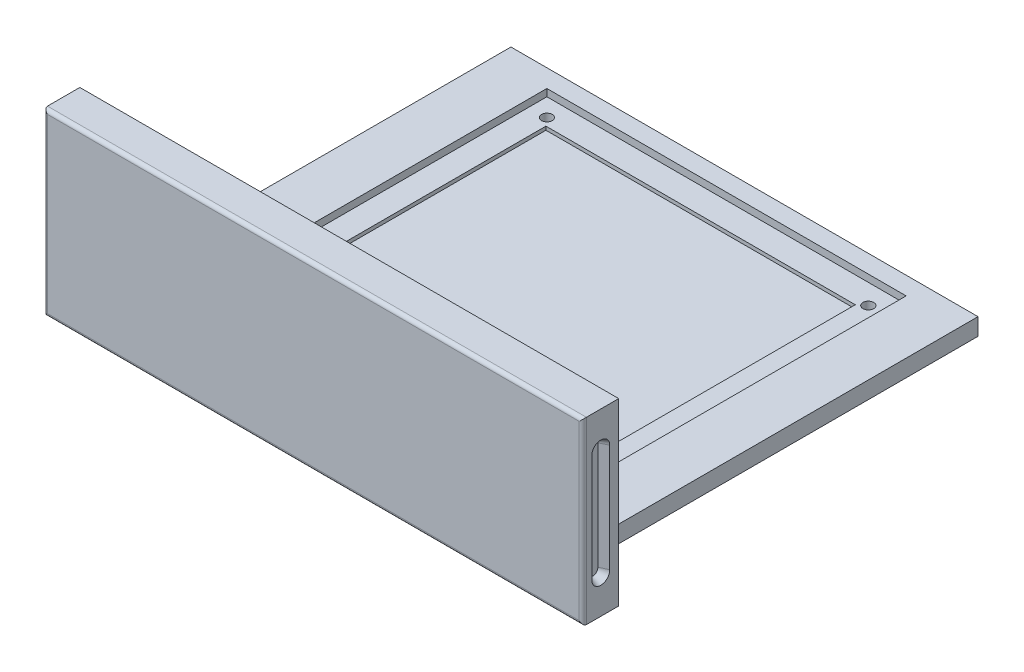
from build123d import *

# Parameters (mm, degrees)
SKETCH1_W            = 130
SKETCH1_H            = 110
BOSS_EXTRUDE1_DEPTH  = 4.75
SKETCH2_W            = 100
SKETCH2_H            = 100
CUT_EXTRUDE1_DEPTH   = 2
CUT_EXTRUDE2_REACH   = 87.191
SKETCH3_R            = 1.5
SKETCH4_W            = 150
SKETCH4_H            = 50
BOSS_EXTRUDE2_DEPTH  = 10
CUT_EXTRUDE3_DEPTH   = 2.25
CUT_EXTRUDE3_DRAFT   = -25
MIRROR1_COPY_1_DEPTH = 2.25
MIRROR1_COPY_1_DRAFT = -25
FILLET1_R            = 1
SKETCH6_W            = 86.111319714
SKETCH6_H            = 85.585611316
CUT_EXTRUDE4_DEPTH   = 1


with BuildPart() as part:
    # Sketch1 → Boss-Extrude1 (new body)
    with BuildSketch(Plane(origin=(0, 0, 0), x_dir=(1, 0, 0), z_dir=(0, 1, 0))):
        Rectangle(SKETCH1_W, SKETCH1_H)
    extrude(amount=BOSS_EXTRUDE1_DEPTH)

    # Sketch2 → Cut-Extrude1 (cut)
    with BuildSketch(Plane(origin=(0, 4.75, 0), x_dir=(1, 0, 0), z_dir=(0, 1, 0))):
        Rectangle(SKETCH2_W, SKETCH2_H)
    extrude(amount=-CUT_EXTRUDE1_DEPTH, mode=Mode.SUBTRACT)

    # Sketch3 → Cut-Extrude2 (cut, up to next)
    with BuildSketch(Plane(origin=(0, 2.75, 0), x_dir=(1, 0, 0), z_dir=(0, 1, 0)), mode=Mode.PRIVATE) as cut_extrude2_sk1:
        with Locations(Location((-45, 45, 0), (0, 0, 270))):
            Circle(SKETCH3_R)
    cut_extrude2_tool1 = extrude(cut_extrude2_sk1.sketch, amount=-CUT_EXTRUDE2_REACH, mode=Mode.PRIVATE) & part.part
    # Sketch3 → Cut-Extrude2 (cut, up to next)
    with BuildSketch(Plane(origin=(0, 2.75, 0), x_dir=(1, 0, 0), z_dir=(0, 1, 0)), mode=Mode.PRIVATE) as cut_extrude2_sk2:
        with Locations(Location((45.055, 44.414, 0), (0, 0, 270))):
            Circle(SKETCH3_R)
    cut_extrude2_tool2 = extrude(cut_extrude2_sk2.sketch, amount=-CUT_EXTRUDE2_REACH, mode=Mode.PRIVATE) & part.part
    # Sketch3 → Cut-Extrude2 (cut, up to next)
    with BuildSketch(Plane(origin=(0, 2.75, 0), x_dir=(1, 0, 0), z_dir=(0, 1, 0)), mode=Mode.PRIVATE) as cut_extrude2_sk3:
        with Locations(Location((-44.97, -44.586, 0), (0, 0, 270))):
            Circle(SKETCH3_R)
    cut_extrude2_tool3 = extrude(cut_extrude2_sk3.sketch, amount=-CUT_EXTRUDE2_REACH, mode=Mode.PRIVATE) & part.part
    # Sketch3 → Cut-Extrude2 (cut, up to next)
    with BuildSketch(Plane(origin=(0, 2.75, 0), x_dir=(1, 0, 0), z_dir=(0, 1, 0)), mode=Mode.PRIVATE) as cut_extrude2_sk4:
        with Locations(Location((45.005, -44.761, 0), (0, 0, 270))):
            Circle(SKETCH3_R)
    cut_extrude2_tool4 = extrude(cut_extrude2_sk4.sketch, amount=-CUT_EXTRUDE2_REACH, mode=Mode.PRIVATE) & part.part
    add(cut_extrude2_tool1.solids().sort_by_distance((-45, 2.75, -45))[0], mode=Mode.SUBTRACT)
    add(cut_extrude2_tool2.solids().sort_by_distance((45.055, 2.75, -44.414))[0], mode=Mode.SUBTRACT)
    add(cut_extrude2_tool3.solids().sort_by_distance((-44.97, 2.75, 44.586))[0], mode=Mode.SUBTRACT)
    add(cut_extrude2_tool4.solids().sort_by_distance((45.005, 2.75, 44.761))[0], mode=Mode.SUBTRACT)

    # Sketch4 → Boss-Extrude2 (add)
    with BuildSketch(Plane.XY.offset(55)):
        with Locations((0, 20)):
            Rectangle(SKETCH4_W, SKETCH4_H)
    extrude(amount=BOSS_EXTRUDE2_DEPTH)


with BuildPart() as cut_extrude3_tool:
    # Sketch5 → Cut-Extrude3 (with draft: the straight prism first)
    with BuildSketch(Plane.ZY.offset(75)):
        with BuildLine():
            ThreePointArc((57.5, 5), (60, 2.5), (62.5, 5))
            Line((62.5, 5), (62.5, 35))
            ThreePointArc((62.5, 35), (60, 37.5), (57.5, 35))
            Line((57.5, 35), (57.5, 5))
        make_face()
    extrude(amount=-CUT_EXTRUDE3_DEPTH)
    # Cut-Extrude3: the draft: its side faces are tilted about the plane it starts from
    cut_extrude3_sides = [cut_extrude3_tool.faces().sort_by_distance(p)[0] for p in [
        (-73.875, 2.5, 60),
        (-73.875, 20, 62.5),
        (-73.875, 37.5, 60),
        (-73.875, 20, 57.5),
    ]]
    draft(cut_extrude3_sides, Plane.ZY.offset(75), CUT_EXTRUDE3_DRAFT)


with BuildPart() as part_1:
    add(part.part)

    # Cut-Extrude3: cut by cut_extrude3_tool
    add(cut_extrude3_tool.part, mode=Mode.SUBTRACT)


with BuildPart() as mirror1_copy_1_tool:
    # Mirror1 copy 1 sketch → Mirror1 copy 1 (with draft: the straight prism first)
    with BuildSketch(Plane(origin=(75, 0, 0), x_dir=(0, 0, 1), z_dir=(1, 0, 0))):
        with BuildLine():
            ThreePointArc((57.5, -5), (60, -2.5), (62.5, -5))
            Line((62.5, -5), (62.5, -35))
            ThreePointArc((62.5, -35), (60, -37.5), (57.5, -35))
            Line((57.5, -35), (57.5, -5))
        make_face()
    extrude(amount=-MIRROR1_COPY_1_DEPTH)
    # Mirror1 copy 1: the draft: its side faces are tilted about the plane it starts from
    mirror1_copy_1_sides = [mirror1_copy_1_tool.faces().sort_by_distance(p)[0] for p in [
        (73.875, 2.5, 60),
        (73.875, 20, 62.5),
        (73.875, 37.5, 60),
        (73.875, 20, 57.5),
    ]]
    draft(mirror1_copy_1_sides, Plane(origin=(75, 0, 0), x_dir=(0, 0, 1), z_dir=(1, 0, 0)), MIRROR1_COPY_1_DRAFT)


with BuildPart() as part_2:
    add(part_1.part)

    # Mirror1 copy 1: cut by mirror1_copy_1_tool
    add(mirror1_copy_1_tool.part, mode=Mode.SUBTRACT)

    # Fillet1
    fillet1_edges = [part_2.edges().sort_by_distance(p)[0] for p in [
        (-75, 20, 65),
        (0, -5, 65),
        (75, 20, 65),
        (0, 45, 65),
    ]]
    fillet(fillet1_edges, radius=FILLET1_R)

    # Sketch6 → Cut-Extrude4 (cut)
    with BuildSketch(Plane(origin=(0, 2.75, 0), x_dir=(1, 0, 0), z_dir=(0, 1, 0))):
        Rectangle(SKETCH6_W, SKETCH6_H)
    extrude(amount=-CUT_EXTRUDE4_DEPTH, mode=Mode.SUBTRACT)


solid = part_2.part
